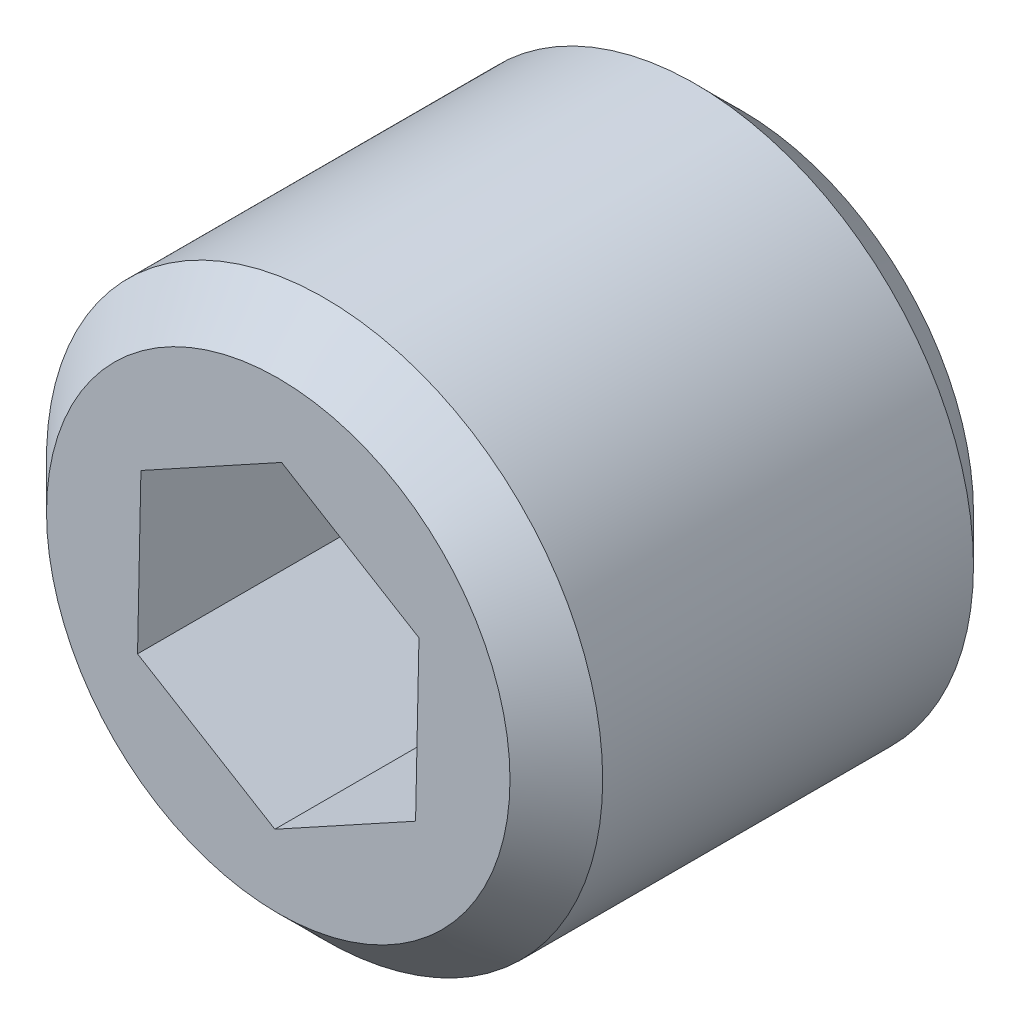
ISO-10303-21;
HEADER;
FILE_DESCRIPTION(('STEP AP214'),'2;1');
FILE_NAME('part.step','',(''),(''),'','','');
FILE_SCHEMA(('AUTOMOTIVE_DESIGN { 1 0 10303 214 1 1 1 1 }'));
ENDSEC;
DATA;
#1=APPLICATION_CONTEXT('core data for automotive mechanical design processes');
#2=APPLICATION_PROTOCOL_DEFINITION('international standard','automotive_design',2000,#1);
#3=PRODUCT_CONTEXT('',#1,'mechanical');
#4=PRODUCT('Part','Part','',(#3));
#5=PRODUCT_RELATED_PRODUCT_CATEGORY('part','',(#4));
#6=PRODUCT_DEFINITION_FORMATION('','',#4);
#7=PRODUCT_DEFINITION_CONTEXT('part definition',#1,'design');
#8=PRODUCT_DEFINITION('design','',#6,#7);
#9=PRODUCT_DEFINITION_SHAPE('','',#8);
#10=(LENGTH_UNIT() NAMED_UNIT(*) SI_UNIT(.MILLI.,.METRE.));
#11=(NAMED_UNIT(*) PLANE_ANGLE_UNIT() SI_UNIT($,.RADIAN.));
#12=(NAMED_UNIT(*) SI_UNIT($,.STERADIAN.) SOLID_ANGLE_UNIT());
#13=UNCERTAINTY_MEASURE_WITH_UNIT(LENGTH_MEASURE(1.E-05),#10,'distance_accuracy_value','');
#14=(GEOMETRIC_REPRESENTATION_CONTEXT(3) GLOBAL_UNCERTAINTY_ASSIGNED_CONTEXT((#13)) GLOBAL_UNIT_ASSIGNED_CONTEXT((#10,
#11,#12)) REPRESENTATION_CONTEXT('',''));
#15=CARTESIAN_POINT('',(0.,0.,0.));
#16=DIRECTION('',(0.,0.,1.));
#17=DIRECTION('',(1.,0.,0.));
#18=AXIS2_PLACEMENT_3D('',#15,#16,#17);
#19=CARTESIAN_POINT('',(0.,0.,10.));
#20=DIRECTION('',(0.,0.,-1.));
#21=DIRECTION('',(-1.,0.,0.));
#22=AXIS2_PLACEMENT_3D('',#19,#20,#21);
#23=CYLINDRICAL_SURFACE('',#22,6.);
#24=CARTESIAN_POINT('',(0.,0.,1.));
#25=DIRECTION('',(0.,0.,1.));
#26=DIRECTION('',(1.,0.,0.));
#27=AXIS2_PLACEMENT_3D('',#24,#25,#26);
#28=CIRCLE('',#27,6.);
#29=CARTESIAN_POINT('',(6.,0.,1.));
#30=VERTEX_POINT('',#29);
#31=EDGE_CURVE('E143',#30,#30,#28,.T.);
#32=ORIENTED_EDGE('',*,*,#31,.T.);
#33=EDGE_LOOP('',(#32));
#34=FACE_BOUND('',#33,.T.);
#35=CARTESIAN_POINT('',(0.,0.,9.));
#36=DIRECTION('',(0.,0.,1.));
#37=DIRECTION('',(1.,0.,0.));
#38=AXIS2_PLACEMENT_3D('',#35,#36,#37);
#39=CIRCLE('',#38,6.);
#40=CARTESIAN_POINT('',(6.,0.,9.));
#41=VERTEX_POINT('',#40);
#42=EDGE_CURVE('E135',#41,#41,#39,.F.);
#43=ORIENTED_EDGE('',*,*,#42,.T.);
#44=EDGE_LOOP('',(#43));
#45=FACE_BOUND('',#44,.T.);
#46=ADVANCED_FACE('F33',(#34,#45),#23,.T.);
#47=CARTESIAN_POINT('',(0.,0.,10.));
#48=DIRECTION('',(0.,0.,1.));
#49=DIRECTION('',(1.,0.,0.));
#50=AXIS2_PLACEMENT_3D('',#47,#48,#49);
#51=PLANE('',#50);
#52=CARTESIAN_POINT('',(0.,0.,10.));
#53=DIRECTION('',(0.,0.,1.));
#54=DIRECTION('',(1.,0.,0.));
#55=AXIS2_PLACEMENT_3D('',#52,#53,#54);
#56=CIRCLE('',#55,5.00000000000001);
#57=CARTESIAN_POINT('',(5.00000000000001,0.,10.));
#58=VERTEX_POINT('',#57);
#59=EDGE_CURVE('E11',#58,#58,#56,.T.);
#60=ORIENTED_EDGE('',*,*,#59,.T.);
#61=EDGE_LOOP('',(#60));
#62=FACE_BOUND('',#61,.T.);
#63=DIRECTION('',(-0.876389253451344,-0.481603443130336,0.));
#64=VECTOR('',#63,1.);
#65=CARTESIAN_POINT('',(0.073140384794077,3.46332939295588,10.));
#66=LINE('',#65,#64);
#67=CARTESIAN_POINT('',(0.073140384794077,3.46332939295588,10.));
#68=VERTEX_POINT('',#67);
#69=CARTESIAN_POINT('',(-2.9627610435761,1.79500612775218,10.));
#70=VERTEX_POINT('',#69);
#71=EDGE_CURVE('E48',#68,#70,#66,.T.);
#72=ORIENTED_EDGE('',*,*,#71,.F.);
#73=DIRECTION('',(-0.855275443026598,0.518173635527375,0.));
#74=VECTOR('',#73,1.);
#75=CARTESIAN_POINT('',(3.03590142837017,1.6683232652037,10.));
#76=LINE('',#75,#74);
#77=CARTESIAN_POINT('',(3.03590142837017,1.6683232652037,10.));
#78=VERTEX_POINT('',#77);
#79=EDGE_CURVE('E131',#78,#68,#76,.T.);
#80=ORIENTED_EDGE('',*,*,#79,.F.);
#81=DIRECTION('',(0.0211138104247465,0.999777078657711,0.));
#82=VECTOR('',#81,1.);
#83=CARTESIAN_POINT('',(2.9627610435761,-1.79500612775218,10.));
#84=LINE('',#83,#82);
#85=CARTESIAN_POINT('',(2.9627610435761,-1.79500612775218,10.));
#86=VERTEX_POINT('',#85);
#87=EDGE_CURVE('E129',#86,#78,#84,.T.);
#88=ORIENTED_EDGE('',*,*,#87,.F.);
#89=DIRECTION('',(0.876389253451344,0.481603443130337,0.));
#90=VECTOR('',#89,1.);
#91=CARTESIAN_POINT('',(-0.0731403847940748,-3.46332939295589,10.));
#92=LINE('',#91,#90);
#93=CARTESIAN_POINT('',(-0.0731403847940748,-3.46332939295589,10.));
#94=VERTEX_POINT('',#93);
#95=EDGE_CURVE('E96',#94,#86,#92,.T.);
#96=ORIENTED_EDGE('',*,*,#95,.F.);
#97=DIRECTION('',(0.855275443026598,-0.518173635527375,0.));
#98=VECTOR('',#97,1.);
#99=CARTESIAN_POINT('',(-3.03590142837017,-1.6683232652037,10.));
#100=LINE('',#99,#98);
#101=CARTESIAN_POINT('',(-3.03590142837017,-1.6683232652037,10.));
#102=VERTEX_POINT('',#101);
#103=EDGE_CURVE('E125',#102,#94,#100,.T.);
#104=ORIENTED_EDGE('',*,*,#103,.F.);
#105=DIRECTION('',(-0.0211138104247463,-0.999777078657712,0.));
#106=VECTOR('',#105,1.);
#107=CARTESIAN_POINT('',(-2.9627610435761,1.79500612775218,10.));
#108=LINE('',#107,#106);
#109=EDGE_CURVE('E122',#70,#102,#108,.T.);
#110=ORIENTED_EDGE('',*,*,#109,.F.);
#111=EDGE_LOOP('',(#72,#80,#88,#96,#104,#110));
#112=FACE_BOUND('',#111,.T.);
#113=ADVANCED_FACE('F157',(#62,#112),#51,.T.);
#114=CARTESIAN_POINT('',(0.,0.,0.));
#115=DIRECTION('',(0.,0.,1.));
#116=DIRECTION('',(1.,0.,0.));
#117=AXIS2_PLACEMENT_3D('',#114,#115,#116);
#118=PLANE('',#117);
#119=CARTESIAN_POINT('',(0.,0.,0.));
#120=DIRECTION('',(0.,0.,1.));
#121=DIRECTION('',(1.,0.,0.));
#122=AXIS2_PLACEMENT_3D('',#119,#120,#121);
#123=CIRCLE('',#122,5.);
#124=CARTESIAN_POINT('',(5.,0.,0.));
#125=VERTEX_POINT('',#124);
#126=EDGE_CURVE('E41',#125,#125,#123,.F.);
#127=ORIENTED_EDGE('',*,*,#126,.T.);
#128=EDGE_LOOP('',(#127));
#129=FACE_BOUND('',#128,.T.);
#130=ADVANCED_FACE('F148',(#129),#118,.F.);
#131=CARTESIAN_POINT('',(0.073140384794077,3.46332939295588,5.));
#132=DIRECTION('',(-0.481603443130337,0.876389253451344,0.));
#133=DIRECTION('',(-0.876389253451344,-0.481603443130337,0.));
#134=AXIS2_PLACEMENT_3D('',#131,#132,#133);
#135=PLANE('',#134);
#136=ORIENTED_EDGE('',*,*,#71,.T.);
#137=DIRECTION('',(0.,0.,1.));
#138=VECTOR('',#137,1.);
#139=CARTESIAN_POINT('',(-2.9627610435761,1.79500612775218,5.));
#140=LINE('',#139,#138);
#141=CARTESIAN_POINT('',(-2.9627610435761,1.79500612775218,5.));
#142=VERTEX_POINT('',#141);
#143=EDGE_CURVE('E78',#142,#70,#140,.T.);
#144=ORIENTED_EDGE('',*,*,#143,.F.);
#145=DIRECTION('',(-0.876389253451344,-0.481603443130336,0.));
#146=VECTOR('',#145,1.);
#147=CARTESIAN_POINT('',(0.073140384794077,3.46332939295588,5.));
#148=LINE('',#147,#146);
#149=CARTESIAN_POINT('',(0.073140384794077,3.46332939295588,5.));
#150=VERTEX_POINT('',#149);
#151=EDGE_CURVE('E133',#150,#142,#148,.T.);
#152=ORIENTED_EDGE('',*,*,#151,.F.);
#153=DIRECTION('',(0.,0.,1.));
#154=VECTOR('',#153,1.);
#155=CARTESIAN_POINT('',(0.073140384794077,3.46332939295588,5.));
#156=LINE('',#155,#154);
#157=EDGE_CURVE('E56',#150,#68,#156,.T.);
#158=ORIENTED_EDGE('',*,*,#157,.T.);
#159=EDGE_LOOP('',(#136,#144,#152,#158));
#160=FACE_BOUND('',#159,.T.);
#161=ADVANCED_FACE('F174',(#160),#135,.F.);
#162=CARTESIAN_POINT('',(3.03590142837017,1.6683232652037,5.));
#163=DIRECTION('',(0.518173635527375,0.855275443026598,0.));
#164=DIRECTION('',(-0.855275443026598,0.518173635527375,0.));
#165=AXIS2_PLACEMENT_3D('',#162,#163,#164);
#166=PLANE('',#165);
#167=ORIENTED_EDGE('',*,*,#79,.T.);
#168=ORIENTED_EDGE('',*,*,#157,.F.);
#169=DIRECTION('',(-0.855275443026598,0.518173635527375,0.));
#170=VECTOR('',#169,1.);
#171=CARTESIAN_POINT('',(3.03590142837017,1.6683232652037,5.));
#172=LINE('',#171,#170);
#173=CARTESIAN_POINT('',(3.03590142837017,1.6683232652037,5.));
#174=VERTEX_POINT('',#173);
#175=EDGE_CURVE('E108',#174,#150,#172,.T.);
#176=ORIENTED_EDGE('',*,*,#175,.F.);
#177=DIRECTION('',(0.,0.,1.));
#178=VECTOR('',#177,1.);
#179=CARTESIAN_POINT('',(3.03590142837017,1.6683232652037,5.));
#180=LINE('',#179,#178);
#181=EDGE_CURVE('E100',#174,#78,#180,.T.);
#182=ORIENTED_EDGE('',*,*,#181,.T.);
#183=EDGE_LOOP('',(#167,#168,#176,#182));
#184=FACE_BOUND('',#183,.T.);
#185=ADVANCED_FACE('F176',(#184),#166,.F.);
#186=CARTESIAN_POINT('',(2.9627610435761,-1.79500612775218,5.));
#187=DIRECTION('',(0.999777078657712,-0.0211138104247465,0.));
#188=DIRECTION('',(0.0211138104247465,0.999777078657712,0.));
#189=AXIS2_PLACEMENT_3D('',#186,#187,#188);
#190=PLANE('',#189);
#191=ORIENTED_EDGE('',*,*,#87,.T.);
#192=ORIENTED_EDGE('',*,*,#181,.F.);
#193=DIRECTION('',(0.0211138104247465,0.999777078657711,0.));
#194=VECTOR('',#193,1.);
#195=CARTESIAN_POINT('',(2.9627610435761,-1.79500612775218,5.));
#196=LINE('',#195,#194);
#197=CARTESIAN_POINT('',(2.9627610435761,-1.79500612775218,5.));
#198=VERTEX_POINT('',#197);
#199=EDGE_CURVE('E104',#198,#174,#196,.T.);
#200=ORIENTED_EDGE('',*,*,#199,.F.);
#201=DIRECTION('',(0.,0.,1.));
#202=VECTOR('',#201,1.);
#203=CARTESIAN_POINT('',(2.9627610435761,-1.79500612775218,5.));
#204=LINE('',#203,#202);
#205=EDGE_CURVE('E89',#198,#86,#204,.T.);
#206=ORIENTED_EDGE('',*,*,#205,.T.);
#207=EDGE_LOOP('',(#191,#192,#200,#206));
#208=FACE_BOUND('',#207,.T.);
#209=ADVANCED_FACE('F105',(#208),#190,.F.);
#210=CARTESIAN_POINT('',(-0.0731403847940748,-3.46332939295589,5.));
#211=DIRECTION('',(0.481603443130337,-0.876389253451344,0.));
#212=DIRECTION('',(0.876389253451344,0.481603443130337,0.));
#213=AXIS2_PLACEMENT_3D('',#210,#211,#212);
#214=PLANE('',#213);
#215=ORIENTED_EDGE('',*,*,#95,.T.);
#216=ORIENTED_EDGE('',*,*,#205,.F.);
#217=DIRECTION('',(0.876389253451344,0.481603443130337,0.));
#218=VECTOR('',#217,1.);
#219=CARTESIAN_POINT('',(-0.0731403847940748,-3.46332939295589,5.));
#220=LINE('',#219,#218);
#221=CARTESIAN_POINT('',(-0.0731403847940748,-3.46332939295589,5.));
#222=VERTEX_POINT('',#221);
#223=EDGE_CURVE('E93',#222,#198,#220,.T.);
#224=ORIENTED_EDGE('',*,*,#223,.F.);
#225=DIRECTION('',(0.,0.,1.));
#226=VECTOR('',#225,1.);
#227=CARTESIAN_POINT('',(-0.0731403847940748,-3.46332939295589,5.));
#228=LINE('',#227,#226);
#229=EDGE_CURVE('E101',#222,#94,#228,.T.);
#230=ORIENTED_EDGE('',*,*,#229,.T.);
#231=EDGE_LOOP('',(#215,#216,#224,#230));
#232=FACE_BOUND('',#231,.T.);
#233=ADVANCED_FACE('F91',(#232),#214,.F.);
#234=CARTESIAN_POINT('',(-3.03590142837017,-1.6683232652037,5.));
#235=DIRECTION('',(-0.518173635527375,-0.855275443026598,0.));
#236=DIRECTION('',(0.855275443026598,-0.518173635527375,0.));
#237=AXIS2_PLACEMENT_3D('',#234,#235,#236);
#238=PLANE('',#237);
#239=ORIENTED_EDGE('',*,*,#103,.T.);
#240=ORIENTED_EDGE('',*,*,#229,.F.);
#241=DIRECTION('',(0.855275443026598,-0.518173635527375,0.));
#242=VECTOR('',#241,1.);
#243=CARTESIAN_POINT('',(-3.03590142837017,-1.6683232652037,5.));
#244=LINE('',#243,#242);
#245=CARTESIAN_POINT('',(-3.03590142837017,-1.6683232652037,5.));
#246=VERTEX_POINT('',#245);
#247=EDGE_CURVE('E114',#246,#222,#244,.T.);
#248=ORIENTED_EDGE('',*,*,#247,.F.);
#249=DIRECTION('',(0.,0.,1.));
#250=VECTOR('',#249,1.);
#251=CARTESIAN_POINT('',(-3.03590142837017,-1.6683232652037,5.));
#252=LINE('',#251,#250);
#253=EDGE_CURVE('E138',#246,#102,#252,.T.);
#254=ORIENTED_EDGE('',*,*,#253,.T.);
#255=EDGE_LOOP('',(#239,#240,#248,#254));
#256=FACE_BOUND('',#255,.T.);
#257=ADVANCED_FACE('F187',(#256),#238,.F.);
#258=CARTESIAN_POINT('',(-2.9627610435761,1.79500612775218,5.));
#259=DIRECTION('',(-0.999777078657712,0.0211138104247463,0.));
#260=DIRECTION('',(-0.0211138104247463,-0.999777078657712,0.));
#261=AXIS2_PLACEMENT_3D('',#258,#259,#260);
#262=PLANE('',#261);
#263=ORIENTED_EDGE('',*,*,#109,.T.);
#264=ORIENTED_EDGE('',*,*,#253,.F.);
#265=DIRECTION('',(-0.0211138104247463,-0.999777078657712,0.));
#266=VECTOR('',#265,1.);
#267=CARTESIAN_POINT('',(-2.9627610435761,1.79500612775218,5.));
#268=LINE('',#267,#266);
#269=EDGE_CURVE('E116',#142,#246,#268,.T.);
#270=ORIENTED_EDGE('',*,*,#269,.F.);
#271=ORIENTED_EDGE('',*,*,#143,.T.);
#272=EDGE_LOOP('',(#263,#264,#270,#271));
#273=FACE_BOUND('',#272,.T.);
#274=ADVANCED_FACE('F172',(#273),#262,.F.);
#275=CARTESIAN_POINT('',(0.,0.,5.));
#276=DIRECTION('',(0.,0.,1.));
#277=DIRECTION('',(1.,0.,0.));
#278=AXIS2_PLACEMENT_3D('',#275,#276,#277);
#279=PLANE('',#278);
#280=ORIENTED_EDGE('',*,*,#151,.T.);
#281=ORIENTED_EDGE('',*,*,#269,.T.);
#282=ORIENTED_EDGE('',*,*,#247,.T.);
#283=ORIENTED_EDGE('',*,*,#223,.T.);
#284=ORIENTED_EDGE('',*,*,#199,.T.);
#285=ORIENTED_EDGE('',*,*,#175,.T.);
#286=EDGE_LOOP('',(#280,#281,#282,#283,#284,#285));
#287=FACE_BOUND('',#286,.T.);
#288=ADVANCED_FACE('F111',(#287),#279,.T.);
#289=CARTESIAN_POINT('',(0.,0.,1.));
#290=DIRECTION('',(0.,0.,1.));
#291=DIRECTION('',(1.,0.,0.));
#292=AXIS2_PLACEMENT_3D('',#289,#290,#291);
#293=CONICAL_SURFACE('',#292,6.,0.785398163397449);
#294=ORIENTED_EDGE('',*,*,#126,.F.);
#295=EDGE_LOOP('',(#294));
#296=FACE_BOUND('',#295,.T.);
#297=ORIENTED_EDGE('',*,*,#31,.F.);
#298=EDGE_LOOP('',(#297));
#299=FACE_BOUND('',#298,.T.);
#300=ADVANCED_FACE('F150',(#296,#299),#293,.T.);
#301=CARTESIAN_POINT('',(0.,0.,10.));
#302=DIRECTION('',(0.,0.,-1.));
#303=DIRECTION('',(-1.,0.,0.));
#304=AXIS2_PLACEMENT_3D('',#301,#302,#303);
#305=CONICAL_SURFACE('',#304,5.00000000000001,0.785398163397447);
#306=ORIENTED_EDGE('',*,*,#42,.F.);
#307=EDGE_LOOP('',(#306));
#308=FACE_BOUND('',#307,.T.);
#309=ORIENTED_EDGE('',*,*,#59,.F.);
#310=EDGE_LOOP('',(#309));
#311=FACE_BOUND('',#310,.T.);
#312=ADVANCED_FACE('F35',(#308,#311),#305,.T.);
#313=CLOSED_SHELL('',(#46,#113,#130,#161,#185,#209,#233,#257,#274,#288,#300,#312));
#314=MANIFOLD_SOLID_BREP('B2',#313);
#315=ADVANCED_BREP_SHAPE_REPRESENTATION('',(#18,#314),#14);
#316=SHAPE_DEFINITION_REPRESENTATION(#9,#315);
ENDSEC;
END-ISO-10303-21;
